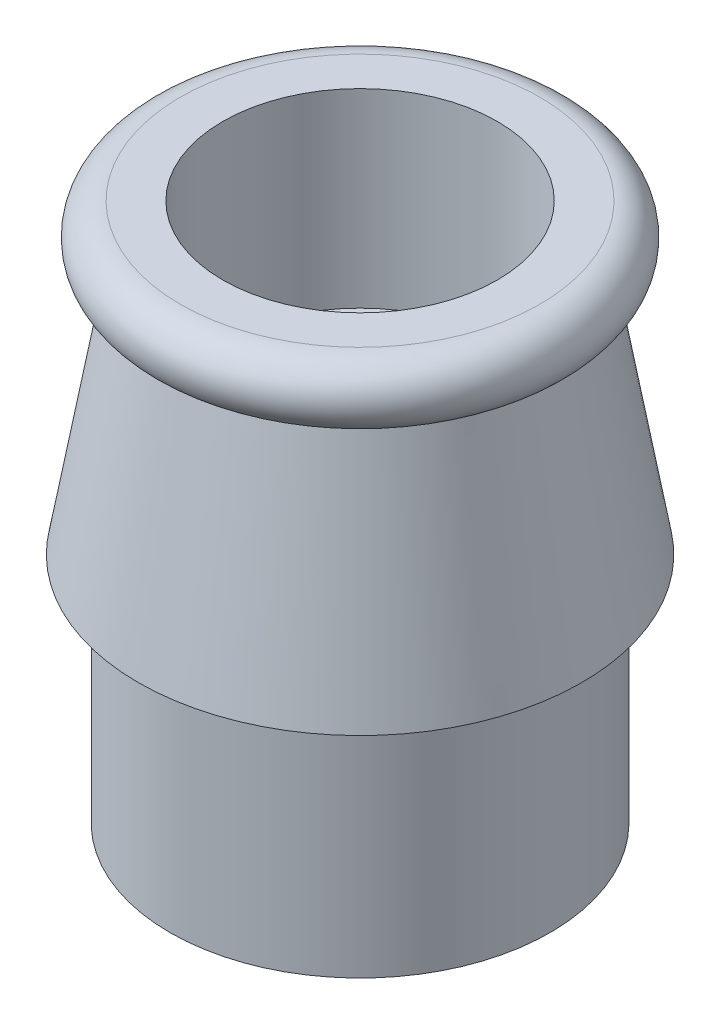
ISO-10303-21;
HEADER;
FILE_DESCRIPTION(('STEP AP214'),'2;1');
FILE_NAME('part.step','',(''),(''),'','','');
FILE_SCHEMA(('AUTOMOTIVE_DESIGN { 1 0 10303 214 1 1 1 1 }'));
ENDSEC;
DATA;
#1=APPLICATION_CONTEXT('core data for automotive mechanical design processes');
#2=APPLICATION_PROTOCOL_DEFINITION('international standard','automotive_design',2000,#1);
#3=PRODUCT_CONTEXT('',#1,'mechanical');
#4=PRODUCT('Part','Part','',(#3));
#5=PRODUCT_RELATED_PRODUCT_CATEGORY('part','',(#4));
#6=PRODUCT_DEFINITION_FORMATION('','',#4);
#7=PRODUCT_DEFINITION_CONTEXT('part definition',#1,'design');
#8=PRODUCT_DEFINITION('design','',#6,#7);
#9=PRODUCT_DEFINITION_SHAPE('','',#8);
#10=(LENGTH_UNIT() NAMED_UNIT(*) SI_UNIT(.MILLI.,.METRE.));
#11=(NAMED_UNIT(*) PLANE_ANGLE_UNIT() SI_UNIT($,.RADIAN.));
#12=(NAMED_UNIT(*) SI_UNIT($,.STERADIAN.) SOLID_ANGLE_UNIT());
#13=UNCERTAINTY_MEASURE_WITH_UNIT(LENGTH_MEASURE(1.E-05),#10,'distance_accuracy_value','');
#14=(GEOMETRIC_REPRESENTATION_CONTEXT(3) GLOBAL_UNCERTAINTY_ASSIGNED_CONTEXT((#13)) GLOBAL_UNIT_ASSIGNED_CONTEXT((#10,
#11,#12)) REPRESENTATION_CONTEXT('',''));
#15=CARTESIAN_POINT('',(0.,0.,0.));
#16=DIRECTION('',(0.,0.,1.));
#17=DIRECTION('',(1.,0.,0.));
#18=AXIS2_PLACEMENT_3D('',#15,#16,#17);
#19=CARTESIAN_POINT('',(0.,8.25,0.));
#20=DIRECTION('',(0.,-1.,0.));
#21=DIRECTION('',(0.,0.,-1.));
#22=AXIS2_PLACEMENT_3D('',#19,#20,#21);
#23=PLANE('',#22);
#24=DIRECTION('',(0.866025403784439,0.,-0.5));
#25=VECTOR('',#24,1.);
#26=CARTESIAN_POINT('',(4.33012701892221,8.25,2.50000000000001));
#27=LINE('',#26,#25);
#28=CARTESIAN_POINT('',(0.,8.25,5.00000000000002));
#29=VERTEX_POINT('',#28);
#30=CARTESIAN_POINT('',(4.33012701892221,8.25,2.50000000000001));
#31=VERTEX_POINT('',#30);
#32=EDGE_CURVE('E105',#29,#31,#27,.T.);
#33=ORIENTED_EDGE('',*,*,#32,.F.);
#34=DIRECTION('',(0.866025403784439,0.,0.5));
#35=VECTOR('',#34,1.);
#36=CARTESIAN_POINT('',(0.,8.25,5.00000000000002));
#37=LINE('',#36,#35);
#38=CARTESIAN_POINT('',(-4.33012701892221,8.25,2.50000000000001));
#39=VERTEX_POINT('',#38);
#40=EDGE_CURVE('E87',#39,#29,#37,.T.);
#41=ORIENTED_EDGE('',*,*,#40,.F.);
#42=DIRECTION('',(0.,0.,1.));
#43=VECTOR('',#42,1.);
#44=CARTESIAN_POINT('',(-4.33012701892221,8.25,2.50000000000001));
#45=LINE('',#44,#43);
#46=CARTESIAN_POINT('',(-4.33012701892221,8.25,-2.50000000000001));
#47=VERTEX_POINT('',#46);
#48=EDGE_CURVE('E96',#47,#39,#45,.T.);
#49=ORIENTED_EDGE('',*,*,#48,.F.);
#50=DIRECTION('',(-0.866025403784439,0.,0.5));
#51=VECTOR('',#50,1.);
#52=CARTESIAN_POINT('',(-4.33012701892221,8.25,-2.50000000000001));
#53=LINE('',#52,#51);
#54=CARTESIAN_POINT('',(0.,8.25,-5.00000000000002));
#55=VERTEX_POINT('',#54);
#56=EDGE_CURVE('E47',#55,#47,#53,.T.);
#57=ORIENTED_EDGE('',*,*,#56,.F.);
#58=DIRECTION('',(-0.866025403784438,0.,-0.500000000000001));
#59=VECTOR('',#58,1.);
#60=CARTESIAN_POINT('',(0.,8.25,-5.00000000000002));
#61=LINE('',#60,#59);
#62=CARTESIAN_POINT('',(4.33012701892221,8.25,-2.50000000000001));
#63=VERTEX_POINT('',#62);
#64=EDGE_CURVE('E284',#63,#55,#61,.T.);
#65=ORIENTED_EDGE('',*,*,#64,.F.);
#66=DIRECTION('',(0.,0.,-1.));
#67=VECTOR('',#66,1.);
#68=CARTESIAN_POINT('',(4.33012701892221,8.25,-2.50000000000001));
#69=LINE('',#68,#67);
#70=EDGE_CURVE('E109',#31,#63,#69,.T.);
#71=ORIENTED_EDGE('',*,*,#70,.F.);
#72=EDGE_LOOP('',(#33,#41,#49,#57,#65,#71));
#73=FACE_BOUND('',#72,.T.);
#74=CARTESIAN_POINT('',(0.,8.24999999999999,0.));
#75=DIRECTION('',(0.,1.,0.));
#76=DIRECTION('',(0.,0.,1.));
#77=AXIS2_PLACEMENT_3D('',#74,#75,#76);
#78=CIRCLE('',#77,6.50000000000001);
#79=CARTESIAN_POINT('',(0.,8.24999999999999,6.50000000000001));
#80=VERTEX_POINT('',#79);
#81=EDGE_CURVE('E11',#80,#80,#78,.T.);
#82=ORIENTED_EDGE('',*,*,#81,.T.);
#83=EDGE_LOOP('',(#82));
#84=FACE_BOUND('',#83,.T.);
#85=ADVANCED_FACE('F33',(#73,#84),#23,.F.);
#86=CARTESIAN_POINT('',(0.,90.,0.));
#87=DIRECTION('',(0.,1.,0.));
#88=DIRECTION('',(0.,0.,1.));
#89=AXIS2_PLACEMENT_3D('',#86,#87,#88);
#90=CYLINDRICAL_SURFACE('',#89,6.50000000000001);
#91=ORIENTED_EDGE('',*,*,#81,.F.);
#92=EDGE_LOOP('',(#91));
#93=FACE_BOUND('',#92,.T.);
#94=CARTESIAN_POINT('',(0.,17.25,0.));
#95=DIRECTION('',(0.,1.,0.));
#96=DIRECTION('',(0.,0.,1.));
#97=AXIS2_PLACEMENT_3D('',#94,#95,#96);
#98=CIRCLE('',#97,6.50000000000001);
#99=CARTESIAN_POINT('',(0.,17.25,6.50000000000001));
#100=VERTEX_POINT('',#99);
#101=EDGE_CURVE('E40',#100,#100,#98,.T.);
#102=ORIENTED_EDGE('',*,*,#101,.T.);
#103=EDGE_LOOP('',(#102));
#104=FACE_BOUND('',#103,.T.);
#105=ADVANCED_FACE('F149',(#93,#104),#90,.F.);
#106=CARTESIAN_POINT('',(6.50000000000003,17.25,0.));
#107=DIRECTION('',(0.,-1.,0.));
#108=DIRECTION('',(0.,0.,-1.));
#109=AXIS2_PLACEMENT_3D('',#106,#107,#108);
#110=PLANE('',#109);
#111=ORIENTED_EDGE('',*,*,#101,.F.);
#112=EDGE_LOOP('',(#111));
#113=FACE_BOUND('',#112,.T.);
#114=CARTESIAN_POINT('',(0.,17.25,0.));
#115=DIRECTION('',(0.,1.,0.));
#116=DIRECTION('',(0.,0.,1.));
#117=AXIS2_PLACEMENT_3D('',#114,#115,#116);
#118=CIRCLE('',#117,8.49999999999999);
#119=CARTESIAN_POINT('',(0.,17.25,8.49999999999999));
#120=VERTEX_POINT('',#119);
#121=EDGE_CURVE('E144',#120,#120,#118,.T.);
#122=ORIENTED_EDGE('',*,*,#121,.T.);
#123=EDGE_LOOP('',(#122));
#124=FACE_BOUND('',#123,.T.);
#125=ADVANCED_FACE('F151',(#113,#124),#110,.F.);
#126=CARTESIAN_POINT('',(0.,15.75,0.));
#127=DIRECTION('',(0.,1.,0.));
#128=DIRECTION('',(0.,0.,1.));
#129=AXIS2_PLACEMENT_3D('',#126,#127,#128);
#130=TOROIDAL_SURFACE('',#129,8.49999999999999,1.5);
#131=ORIENTED_EDGE('',*,*,#121,.F.);
#132=EDGE_LOOP('',(#131));
#133=FACE_BOUND('',#132,.T.);
#134=CARTESIAN_POINT('',(0.,14.25,0.));
#135=DIRECTION('',(0.,1.,0.));
#136=DIRECTION('',(0.,0.,1.));
#137=AXIS2_PLACEMENT_3D('',#134,#135,#136);
#138=CIRCLE('',#137,8.49999999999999);
#139=CARTESIAN_POINT('',(0.,14.25,8.49999999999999));
#140=VERTEX_POINT('',#139);
#141=EDGE_CURVE('E141',#140,#140,#138,.T.);
#142=ORIENTED_EDGE('',*,*,#141,.T.);
#143=EDGE_LOOP('',(#142));
#144=FACE_BOUND('',#143,.T.);
#145=ADVANCED_FACE('F154',(#133,#144),#130,.T.);
#146=CARTESIAN_POINT('',(0.,2.75,0.));
#147=DIRECTION('',(0.,-1.,0.));
#148=DIRECTION('',(0.,0.,-1.));
#149=AXIS2_PLACEMENT_3D('',#146,#147,#148);
#150=CONICAL_SURFACE('',#149,10.5,0.172190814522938);
#151=ORIENTED_EDGE('',*,*,#141,.F.);
#152=EDGE_LOOP('',(#151));
#153=FACE_BOUND('',#152,.T.);
#154=CARTESIAN_POINT('',(0.,2.75,0.));
#155=DIRECTION('',(0.,1.,0.));
#156=DIRECTION('',(0.,0.,1.));
#157=AXIS2_PLACEMENT_3D('',#154,#155,#156);
#158=CIRCLE('',#157,10.5);
#159=CARTESIAN_POINT('',(0.,2.75,10.5));
#160=VERTEX_POINT('',#159);
#161=EDGE_CURVE('E138',#160,#160,#158,.T.);
#162=ORIENTED_EDGE('',*,*,#161,.T.);
#163=EDGE_LOOP('',(#162));
#164=FACE_BOUND('',#163,.T.);
#165=ADVANCED_FACE('F160',(#153,#164),#150,.T.);
#166=CARTESIAN_POINT('',(10.5,2.75,0.));
#167=DIRECTION('',(0.,1.,0.));
#168=DIRECTION('',(0.,0.,1.));
#169=AXIS2_PLACEMENT_3D('',#166,#167,#168);
#170=PLANE('',#169);
#171=ORIENTED_EDGE('',*,*,#161,.F.);
#172=EDGE_LOOP('',(#171));
#173=FACE_BOUND('',#172,.T.);
#174=CARTESIAN_POINT('',(0.,2.75,0.));
#175=DIRECTION('',(0.,1.,0.));
#176=DIRECTION('',(0.,0.,1.));
#177=AXIS2_PLACEMENT_3D('',#174,#175,#176);
#178=CIRCLE('',#177,8.99999999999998);
#179=CARTESIAN_POINT('',(0.,2.75,8.99999999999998));
#180=VERTEX_POINT('',#179);
#181=EDGE_CURVE('E135',#180,#180,#178,.T.);
#182=ORIENTED_EDGE('',*,*,#181,.T.);
#183=EDGE_LOOP('',(#182));
#184=FACE_BOUND('',#183,.T.);
#185=ADVANCED_FACE('F166',(#173,#184),#170,.F.);
#186=CARTESIAN_POINT('',(0.,90.,0.));
#187=DIRECTION('',(0.,1.,0.));
#188=DIRECTION('',(0.,0.,1.));
#189=AXIS2_PLACEMENT_3D('',#186,#187,#188);
#190=CYLINDRICAL_SURFACE('',#189,8.99999999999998);
#191=ORIENTED_EDGE('',*,*,#181,.F.);
#192=EDGE_LOOP('',(#191));
#193=FACE_BOUND('',#192,.T.);
#194=CARTESIAN_POINT('',(0.,-8.24999999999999,0.));
#195=DIRECTION('',(0.,1.,0.));
#196=DIRECTION('',(0.,0.,1.));
#197=AXIS2_PLACEMENT_3D('',#194,#195,#196);
#198=CIRCLE('',#197,8.99999999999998);
#199=CARTESIAN_POINT('',(0.,-8.24999999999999,8.99999999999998));
#200=VERTEX_POINT('',#199);
#201=EDGE_CURVE('E99',#200,#200,#198,.T.);
#202=ORIENTED_EDGE('',*,*,#201,.T.);
#203=EDGE_LOOP('',(#202));
#204=FACE_BOUND('',#203,.T.);
#205=ADVANCED_FACE('F172',(#193,#204),#190,.T.);
#206=CARTESIAN_POINT('',(9.,-8.25,0.));
#207=DIRECTION('',(0.,1.,0.));
#208=DIRECTION('',(0.,0.,1.));
#209=AXIS2_PLACEMENT_3D('',#206,#207,#208);
#210=PLANE('',#209);
#211=DIRECTION('',(0.,0.,-1.));
#212=VECTOR('',#211,1.);
#213=CARTESIAN_POINT('',(-4.33012701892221,-8.25,2.50000000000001));
#214=LINE('',#213,#212);
#215=CARTESIAN_POINT('',(-4.33012701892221,-8.25,2.50000000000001));
#216=VERTEX_POINT('',#215);
#217=CARTESIAN_POINT('',(-4.33012701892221,-8.25,-2.50000000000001));
#218=VERTEX_POINT('',#217);
#219=EDGE_CURVE('E107',#216,#218,#214,.T.);
#220=ORIENTED_EDGE('',*,*,#219,.F.);
#221=DIRECTION('',(-0.866025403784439,0.,-0.5));
#222=VECTOR('',#221,1.);
#223=CARTESIAN_POINT('',(0.,-8.25,5.00000000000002));
#224=LINE('',#223,#222);
#225=CARTESIAN_POINT('',(0.,-8.25,5.00000000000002));
#226=VERTEX_POINT('',#225);
#227=EDGE_CURVE('E55',#226,#216,#224,.T.);
#228=ORIENTED_EDGE('',*,*,#227,.F.);
#229=DIRECTION('',(-0.866025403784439,0.,0.5));
#230=VECTOR('',#229,1.);
#231=CARTESIAN_POINT('',(4.33012701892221,-8.25,2.50000000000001));
#232=LINE('',#231,#230);
#233=CARTESIAN_POINT('',(4.33012701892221,-8.25,2.50000000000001));
#234=VERTEX_POINT('',#233);
#235=EDGE_CURVE('E93',#234,#226,#232,.T.);
#236=ORIENTED_EDGE('',*,*,#235,.F.);
#237=DIRECTION('',(0.,0.,1.));
#238=VECTOR('',#237,1.);
#239=CARTESIAN_POINT('',(4.33012701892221,-8.25,-2.50000000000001));
#240=LINE('',#239,#238);
#241=CARTESIAN_POINT('',(4.33012701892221,-8.25,-2.50000000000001));
#242=VERTEX_POINT('',#241);
#243=EDGE_CURVE('E120',#242,#234,#240,.T.);
#244=ORIENTED_EDGE('',*,*,#243,.F.);
#245=DIRECTION('',(0.866025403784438,0.,0.500000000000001));
#246=VECTOR('',#245,1.);
#247=CARTESIAN_POINT('',(0.,-8.25,-5.00000000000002));
#248=LINE('',#247,#246);
#249=CARTESIAN_POINT('',(0.,-8.25,-5.00000000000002));
#250=VERTEX_POINT('',#249);
#251=EDGE_CURVE('E117',#250,#242,#248,.T.);
#252=ORIENTED_EDGE('',*,*,#251,.F.);
#253=DIRECTION('',(0.866025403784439,0.,-0.5));
#254=VECTOR('',#253,1.);
#255=CARTESIAN_POINT('',(-4.33012701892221,-8.25,-2.50000000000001));
#256=LINE('',#255,#254);
#257=EDGE_CURVE('E114',#218,#250,#256,.T.);
#258=ORIENTED_EDGE('',*,*,#257,.F.);
#259=EDGE_LOOP('',(#220,#228,#236,#244,#252,#258));
#260=FACE_BOUND('',#259,.T.);
#261=ORIENTED_EDGE('',*,*,#201,.F.);
#262=EDGE_LOOP('',(#261));
#263=FACE_BOUND('',#262,.T.);
#264=ADVANCED_FACE('F178',(#260,#263),#210,.F.);
#265=CARTESIAN_POINT('',(0.,17.251,5.00000000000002));
#266=DIRECTION('',(-0.5,0.,0.866025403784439));
#267=DIRECTION('',(0.866025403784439,0.,0.5));
#268=AXIS2_PLACEMENT_3D('',#265,#266,#267);
#269=PLANE('',#268);
#270=ORIENTED_EDGE('',*,*,#40,.T.);
#271=DIRECTION('',(0.,-1.,0.));
#272=VECTOR('',#271,1.);
#273=CARTESIAN_POINT('',(0.,17.251,5.00000000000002));
#274=LINE('',#273,#272);
#275=EDGE_CURVE('E100',#29,#226,#274,.T.);
#276=ORIENTED_EDGE('',*,*,#275,.T.);
#277=ORIENTED_EDGE('',*,*,#227,.T.);
#278=DIRECTION('',(0.,-1.,0.));
#279=VECTOR('',#278,1.);
#280=CARTESIAN_POINT('',(-4.33012701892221,17.251,2.50000000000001));
#281=LINE('',#280,#279);
#282=EDGE_CURVE('E83',#39,#216,#281,.T.);
#283=ORIENTED_EDGE('',*,*,#282,.F.);
#284=EDGE_LOOP('',(#270,#276,#277,#283));
#285=FACE_BOUND('',#284,.T.);
#286=ADVANCED_FACE('F85',(#285),#269,.F.);
#287=CARTESIAN_POINT('',(4.33012701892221,17.251,2.50000000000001));
#288=DIRECTION('',(0.5,0.,0.866025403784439));
#289=DIRECTION('',(0.866025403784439,0.,-0.5));
#290=AXIS2_PLACEMENT_3D('',#287,#288,#289);
#291=PLANE('',#290);
#292=ORIENTED_EDGE('',*,*,#32,.T.);
#293=DIRECTION('',(0.,-1.,0.));
#294=VECTOR('',#293,1.);
#295=CARTESIAN_POINT('',(4.33012701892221,17.251,2.50000000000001));
#296=LINE('',#295,#294);
#297=EDGE_CURVE('E126',#31,#234,#296,.T.);
#298=ORIENTED_EDGE('',*,*,#297,.T.);
#299=ORIENTED_EDGE('',*,*,#235,.T.);
#300=ORIENTED_EDGE('',*,*,#275,.F.);
#301=EDGE_LOOP('',(#292,#298,#299,#300));
#302=FACE_BOUND('',#301,.T.);
#303=ADVANCED_FACE('F188',(#302),#291,.F.);
#304=CARTESIAN_POINT('',(4.33012701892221,17.251,-2.50000000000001));
#305=DIRECTION('',(1.,0.,0.));
#306=DIRECTION('',(0.,0.,-1.));
#307=AXIS2_PLACEMENT_3D('',#304,#305,#306);
#308=PLANE('',#307);
#309=ORIENTED_EDGE('',*,*,#70,.T.);
#310=DIRECTION('',(0.,-1.,0.));
#311=VECTOR('',#310,1.);
#312=CARTESIAN_POINT('',(4.33012701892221,17.251,-2.50000000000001));
#313=LINE('',#312,#311);
#314=EDGE_CURVE('E128',#63,#242,#313,.T.);
#315=ORIENTED_EDGE('',*,*,#314,.T.);
#316=ORIENTED_EDGE('',*,*,#243,.T.);
#317=ORIENTED_EDGE('',*,*,#297,.F.);
#318=EDGE_LOOP('',(#309,#315,#316,#317));
#319=FACE_BOUND('',#318,.T.);
#320=ADVANCED_FACE('F241',(#319),#308,.F.);
#321=CARTESIAN_POINT('',(0.,17.251,-5.00000000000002));
#322=DIRECTION('',(0.500000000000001,0.,-0.866025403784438));
#323=DIRECTION('',(-0.866025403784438,0.,-0.500000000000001));
#324=AXIS2_PLACEMENT_3D('',#321,#322,#323);
#325=PLANE('',#324);
#326=ORIENTED_EDGE('',*,*,#64,.T.);
#327=DIRECTION('',(0.,-1.,0.));
#328=VECTOR('',#327,1.);
#329=CARTESIAN_POINT('',(0.,17.251,-5.00000000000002));
#330=LINE('',#329,#328);
#331=EDGE_CURVE('E130',#55,#250,#330,.T.);
#332=ORIENTED_EDGE('',*,*,#331,.T.);
#333=ORIENTED_EDGE('',*,*,#251,.T.);
#334=ORIENTED_EDGE('',*,*,#314,.F.);
#335=EDGE_LOOP('',(#326,#332,#333,#334));
#336=FACE_BOUND('',#335,.T.);
#337=ADVANCED_FACE('F251',(#336),#325,.F.);
#338=CARTESIAN_POINT('',(-4.33012701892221,17.251,-2.50000000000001));
#339=DIRECTION('',(-0.5,0.,-0.866025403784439));
#340=DIRECTION('',(-0.866025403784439,0.,0.5));
#341=AXIS2_PLACEMENT_3D('',#338,#339,#340);
#342=PLANE('',#341);
#343=ORIENTED_EDGE('',*,*,#56,.T.);
#344=DIRECTION('',(0.,-1.,0.));
#345=VECTOR('',#344,1.);
#346=CARTESIAN_POINT('',(-4.33012701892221,17.251,-2.50000000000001));
#347=LINE('',#346,#345);
#348=EDGE_CURVE('E92',#47,#218,#347,.T.);
#349=ORIENTED_EDGE('',*,*,#348,.T.);
#350=ORIENTED_EDGE('',*,*,#257,.T.);
#351=ORIENTED_EDGE('',*,*,#331,.F.);
#352=EDGE_LOOP('',(#343,#349,#350,#351));
#353=FACE_BOUND('',#352,.T.);
#354=ADVANCED_FACE('F261',(#353),#342,.F.);
#355=CARTESIAN_POINT('',(-4.33012701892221,17.251,2.50000000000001));
#356=DIRECTION('',(-1.,0.,0.));
#357=DIRECTION('',(0.,0.,1.));
#358=AXIS2_PLACEMENT_3D('',#355,#356,#357);
#359=PLANE('',#358);
#360=ORIENTED_EDGE('',*,*,#48,.T.);
#361=ORIENTED_EDGE('',*,*,#282,.T.);
#362=ORIENTED_EDGE('',*,*,#219,.T.);
#363=ORIENTED_EDGE('',*,*,#348,.F.);
#364=EDGE_LOOP('',(#360,#361,#362,#363));
#365=FACE_BOUND('',#364,.T.);
#366=ADVANCED_FACE('F97',(#365),#359,.F.);
#367=CLOSED_SHELL('',(#85,#105,#125,#145,#165,#185,#205,#264,#286,#303,#320,#337,#354,#366));
#368=MANIFOLD_SOLID_BREP('B2',#367);
#369=ADVANCED_BREP_SHAPE_REPRESENTATION('',(#18,#368),#14);
#370=SHAPE_DEFINITION_REPRESENTATION(#9,#369);
ENDSEC;
END-ISO-10303-21;
